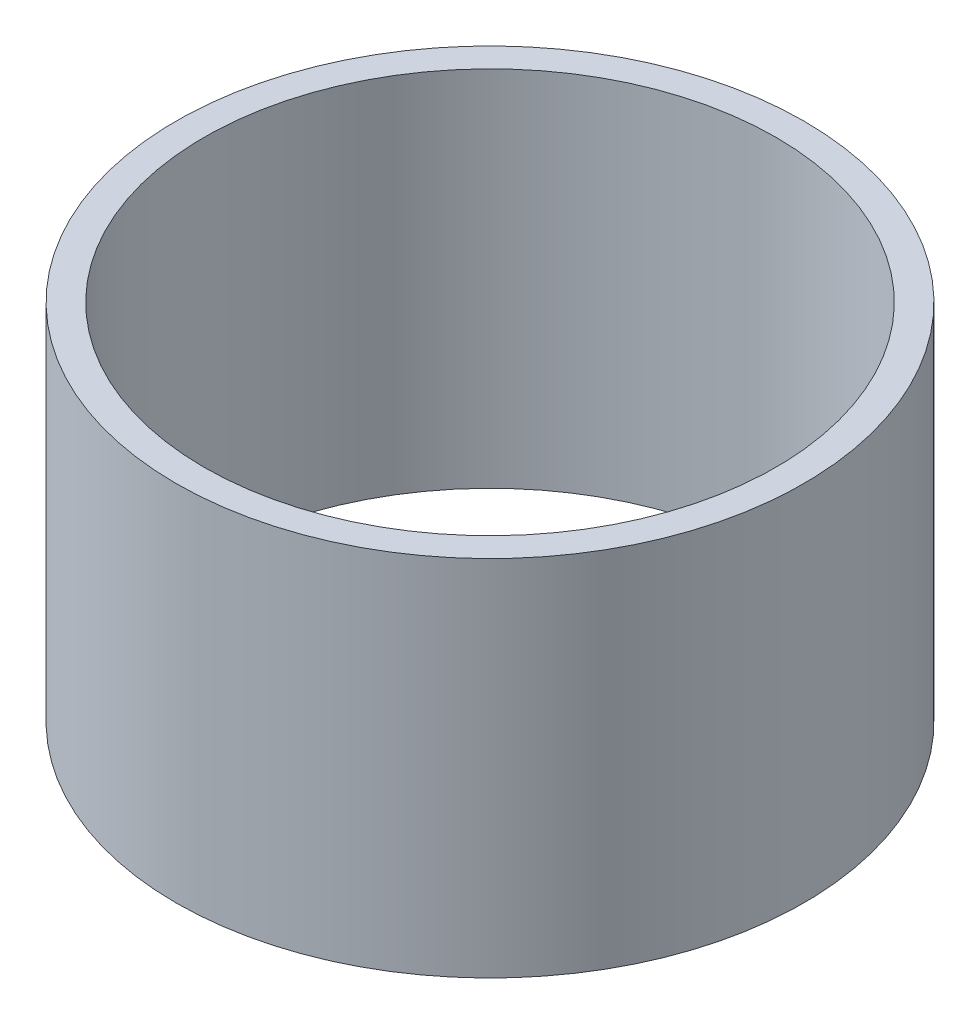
from build123d import *

# Parameters (mm, degrees)
SKETCH_1_R      = 14
SKETCH_1_R_2    = 12.75
EXTRUDE_1_DEPTH = 16.2


with BuildPart() as part:
    # Sketch 1 → Extrude 1 (new body)
    with BuildSketch(Plane(origin=(0, 0, 0), x_dir=(1, 0, 0), z_dir=(0, 1, 0))):
        with Locations(Location((0, 0, 0), (0, 0, 270))):
            Circle(SKETCH_1_R)
        with Locations(Location((0, 0, 0), (0, 0, 270))):
            Circle(SKETCH_1_R_2, mode=Mode.SUBTRACT)
    extrude(amount=EXTRUDE_1_DEPTH)


solid = part.part
